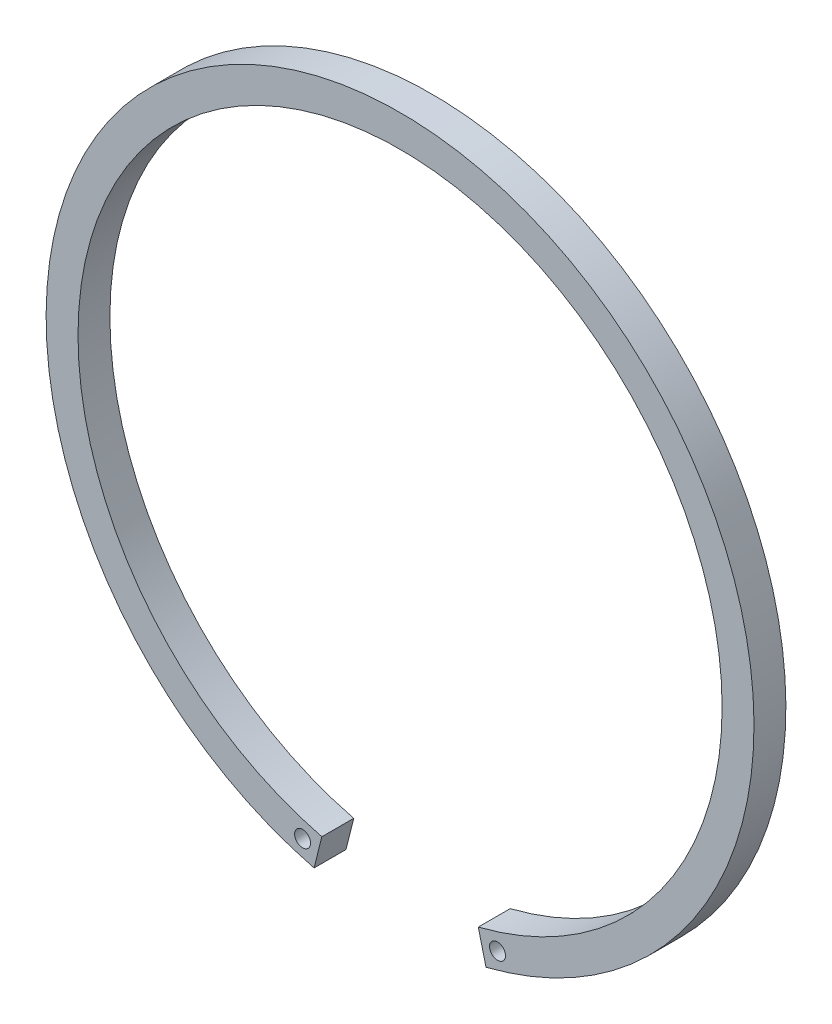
ISO-10303-21;
HEADER;
FILE_DESCRIPTION(('STEP AP214'),'2;1');
FILE_NAME('part.step','',(''),(''),'','','');
FILE_SCHEMA(('AUTOMOTIVE_DESIGN { 1 0 10303 214 1 1 1 1 }'));
ENDSEC;
DATA;
#1=APPLICATION_CONTEXT('core data for automotive mechanical design processes');
#2=APPLICATION_PROTOCOL_DEFINITION('international standard','automotive_design',2000,#1);
#3=PRODUCT_CONTEXT('',#1,'mechanical');
#4=PRODUCT('Part','Part','',(#3));
#5=PRODUCT_RELATED_PRODUCT_CATEGORY('part','',(#4));
#6=PRODUCT_DEFINITION_FORMATION('','',#4);
#7=PRODUCT_DEFINITION_CONTEXT('part definition',#1,'design');
#8=PRODUCT_DEFINITION('design','',#6,#7);
#9=PRODUCT_DEFINITION_SHAPE('','',#8);
#10=(LENGTH_UNIT() NAMED_UNIT(*) SI_UNIT(.MILLI.,.METRE.));
#11=(NAMED_UNIT(*) PLANE_ANGLE_UNIT() SI_UNIT($,.RADIAN.));
#12=(NAMED_UNIT(*) SI_UNIT($,.STERADIAN.) SOLID_ANGLE_UNIT());
#13=UNCERTAINTY_MEASURE_WITH_UNIT(LENGTH_MEASURE(1.E-05),#10,'distance_accuracy_value','');
#14=(GEOMETRIC_REPRESENTATION_CONTEXT(3) GLOBAL_UNCERTAINTY_ASSIGNED_CONTEXT((#13)) GLOBAL_UNIT_ASSIGNED_CONTEXT((#10,
#11,#12)) REPRESENTATION_CONTEXT('',''));
#15=CARTESIAN_POINT('',(0.,0.,0.));
#16=DIRECTION('',(0.,0.,1.));
#17=DIRECTION('',(1.,0.,0.));
#18=AXIS2_PLACEMENT_3D('',#15,#16,#17);
#19=CARTESIAN_POINT('',(-57.73146113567,-56.02523486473,5.));
#20=DIRECTION('',(0.,0.,1.));
#21=DIRECTION('',(1.,0.,0.));
#22=AXIS2_PLACEMENT_3D('',#19,#20,#21);
#23=PLANE('',#22);
#24=CARTESIAN_POINT('',(-15.2821772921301,-50.74894143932,5.));
#25=DIRECTION('',(0.,0.,1.));
#26=DIRECTION('',(1.,0.,0.));
#27=AXIS2_PLACEMENT_3D('',#24,#25,#26);
#28=CIRCLE('',#27,1.25);
#29=CARTESIAN_POINT('',(-14.0321772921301,-50.74894143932,5.));
#30=VERTEX_POINT('',#29);
#31=EDGE_CURVE('E100',#30,#30,#28,.F.);
#32=ORIENTED_EDGE('',*,*,#31,.T.);
#33=EDGE_LOOP('',(#32));
#34=FACE_BOUND('',#33,.T.);
#35=CARTESIAN_POINT('',(15.2821772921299,-50.74894143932,5.));
#36=DIRECTION('',(0.,0.,1.));
#37=DIRECTION('',(1.,0.,0.));
#38=AXIS2_PLACEMENT_3D('',#35,#36,#37);
#39=CIRCLE('',#38,1.25);
#40=CARTESIAN_POINT('',(16.5321772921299,-50.74894143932,5.));
#41=VERTEX_POINT('',#40);
#42=EDGE_CURVE('E77',#41,#41,#39,.F.);
#43=ORIENTED_EDGE('',*,*,#42,.T.);
#44=EDGE_LOOP('',(#43));
#45=FACE_BOUND('',#44,.T.);
#46=CARTESIAN_POINT('',(0.,0.,5.));
#47=DIRECTION('',(0.,0.,1.));
#48=DIRECTION('',(1.,0.,0.));
#49=AXIS2_PLACEMENT_3D('',#46,#47,#48);
#50=CIRCLE('',#49,50.5);
#51=CARTESIAN_POINT('',(-12.2642093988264,-48.9881533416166,5.));
#52=VERTEX_POINT('',#51);
#53=CARTESIAN_POINT('',(12.2642093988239,-48.9881533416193,5.));
#54=VERTEX_POINT('',#53);
#55=EDGE_CURVE('E80',#52,#54,#50,.F.);
#56=ORIENTED_EDGE('',*,*,#55,.T.);
#57=DIRECTION('',(-0.242855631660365,0.97006244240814,0.));
#58=VECTOR('',#57,1.);
#59=CARTESIAN_POINT('',(12.8713484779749,-51.41330944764,5.));
#60=LINE('',#59,#58);
#61=CARTESIAN_POINT('',(13.4784875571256,-53.8384655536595,5.));
#62=VERTEX_POINT('',#61);
#63=EDGE_CURVE('E75',#54,#62,#60,.F.);
#64=ORIENTED_EDGE('',*,*,#63,.T.);
#65=CARTESIAN_POINT('',(0.,0.,5.));
#66=DIRECTION('',(0.,0.,1.));
#67=DIRECTION('',(1.,0.,0.));
#68=AXIS2_PLACEMENT_3D('',#65,#66,#67);
#69=CIRCLE('',#68,55.5);
#70=CARTESIAN_POINT('',(-13.4784875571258,-53.8384655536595,5.));
#71=VERTEX_POINT('',#70);
#72=EDGE_CURVE('E29',#62,#71,#69,.T.);
#73=ORIENTED_EDGE('',*,*,#72,.T.);
#74=DIRECTION('',(-0.242855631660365,-0.97006244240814,0.));
#75=VECTOR('',#74,1.);
#76=CARTESIAN_POINT('',(-12.8713484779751,-51.41330944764,5.));
#77=LINE('',#76,#75);
#78=EDGE_CURVE('E86',#71,#52,#77,.F.);
#79=ORIENTED_EDGE('',*,*,#78,.T.);
#80=EDGE_LOOP('',(#56,#64,#73,#79));
#81=FACE_BOUND('',#80,.T.);
#82=ADVANCED_FACE('F25',(#34,#45,#81),#23,.T.);
#83=CARTESIAN_POINT('',(0.,0.,0.));
#84=DIRECTION('',(0.,0.,1.));
#85=DIRECTION('',(1.,0.,0.));
#86=AXIS2_PLACEMENT_3D('',#83,#84,#85);
#87=CYLINDRICAL_SURFACE('',#86,55.5);
#88=ORIENTED_EDGE('',*,*,#72,.F.);
#89=DIRECTION('',(0.,0.,1.));
#90=VECTOR('',#89,1.);
#91=CARTESIAN_POINT('',(13.4784875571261,-53.838465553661,2.49999999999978));
#92=LINE('',#91,#90);
#93=CARTESIAN_POINT('',(13.4784875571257,-53.8384655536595,0.));
#94=VERTEX_POINT('',#93);
#95=EDGE_CURVE('E69',#62,#94,#92,.F.);
#96=ORIENTED_EDGE('',*,*,#95,.T.);
#97=CARTESIAN_POINT('',(0.,0.,0.));
#98=DIRECTION('',(0.,0.,1.));
#99=DIRECTION('',(1.,0.,0.));
#100=AXIS2_PLACEMENT_3D('',#97,#98,#99);
#101=CIRCLE('',#100,55.5);
#102=CARTESIAN_POINT('',(-13.4784875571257,-53.8384655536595,0.));
#103=VERTEX_POINT('',#102);
#104=EDGE_CURVE('E98',#94,#103,#101,.T.);
#105=ORIENTED_EDGE('',*,*,#104,.T.);
#106=DIRECTION('',(0.,0.,-1.));
#107=VECTOR('',#106,1.);
#108=CARTESIAN_POINT('',(-13.4784875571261,-53.838465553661,2.49999999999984));
#109=LINE('',#108,#107);
#110=EDGE_CURVE('E70',#103,#71,#109,.F.);
#111=ORIENTED_EDGE('',*,*,#110,.T.);
#112=EDGE_LOOP('',(#88,#96,#105,#111));
#113=FACE_BOUND('',#112,.T.);
#114=ADVANCED_FACE('F67',(#113),#87,.T.);
#115=CARTESIAN_POINT('',(-13.52392190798,-54.01994850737,-0.187083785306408));
#116=DIRECTION('',(0.97006244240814,-0.242855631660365,0.));
#117=DIRECTION('',(0.242855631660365,0.97006244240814,0.));
#118=AXIS2_PLACEMENT_3D('',#115,#116,#117);
#119=PLANE('',#118);
#120=ORIENTED_EDGE('',*,*,#78,.F.);
#121=ORIENTED_EDGE('',*,*,#110,.F.);
#122=DIRECTION('',(0.242855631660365,0.97006244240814,0.));
#123=VECTOR('',#122,1.);
#124=CARTESIAN_POINT('',(-13.52392190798,-54.01994850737,0.));
#125=LINE('',#124,#123);
#126=CARTESIAN_POINT('',(-12.2642093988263,-48.9881533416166,0.));
#127=VERTEX_POINT('',#126);
#128=EDGE_CURVE('E95',#103,#127,#125,.T.);
#129=ORIENTED_EDGE('',*,*,#128,.T.);
#130=DIRECTION('',(0.,0.,-1.));
#131=VECTOR('',#130,1.);
#132=CARTESIAN_POINT('',(-12.264209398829,-48.9881533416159,2.49999999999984));
#133=LINE('',#132,#131);
#134=EDGE_CURVE('E87',#127,#52,#133,.F.);
#135=ORIENTED_EDGE('',*,*,#134,.T.);
#136=EDGE_LOOP('',(#120,#121,#129,#135));
#137=FACE_BOUND('',#136,.T.);
#138=ADVANCED_FACE('F106',(#137),#119,.T.);
#139=CARTESIAN_POINT('',(0.,0.,0.));
#140=DIRECTION('',(0.,0.,1.));
#141=DIRECTION('',(1.,0.,0.));
#142=AXIS2_PLACEMENT_3D('',#139,#140,#141);
#143=CYLINDRICAL_SURFACE('',#142,50.5);
#144=ORIENTED_EDGE('',*,*,#55,.F.);
#145=ORIENTED_EDGE('',*,*,#134,.F.);
#146=CARTESIAN_POINT('',(0.,0.,0.));
#147=DIRECTION('',(0.,0.,1.));
#148=DIRECTION('',(1.,0.,0.));
#149=AXIS2_PLACEMENT_3D('',#146,#147,#148);
#150=CIRCLE('',#149,50.5);
#151=CARTESIAN_POINT('',(12.264209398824,-48.9881533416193,0.));
#152=VERTEX_POINT('',#151);
#153=EDGE_CURVE('E92',#127,#152,#150,.F.);
#154=ORIENTED_EDGE('',*,*,#153,.T.);
#155=DIRECTION('',(0.,0.,-1.));
#156=VECTOR('',#155,1.);
#157=CARTESIAN_POINT('',(12.2642093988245,-48.9881533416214,2.49999999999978));
#158=LINE('',#157,#156);
#159=EDGE_CURVE('E44',#152,#54,#158,.F.);
#160=ORIENTED_EDGE('',*,*,#159,.T.);
#161=EDGE_LOOP('',(#144,#145,#154,#160));
#162=FACE_BOUND('',#161,.T.);
#163=ADVANCED_FACE('F110',(#162),#143,.F.);
#164=CARTESIAN_POINT('',(12.21877504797,-48.80667038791,-0.187083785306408));
#165=DIRECTION('',(-0.97006244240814,-0.242855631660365,0.));
#166=DIRECTION('',(0.242855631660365,-0.97006244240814,0.));
#167=AXIS2_PLACEMENT_3D('',#164,#165,#166);
#168=PLANE('',#167);
#169=ORIENTED_EDGE('',*,*,#63,.F.);
#170=ORIENTED_EDGE('',*,*,#159,.F.);
#171=DIRECTION('',(0.242855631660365,-0.97006244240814,0.));
#172=VECTOR('',#171,1.);
#173=CARTESIAN_POINT('',(12.21877504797,-48.80667038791,0.));
#174=LINE('',#173,#172);
#175=EDGE_CURVE('E76',#152,#94,#174,.T.);
#176=ORIENTED_EDGE('',*,*,#175,.T.);
#177=ORIENTED_EDGE('',*,*,#95,.F.);
#178=EDGE_LOOP('',(#169,#170,#176,#177));
#179=FACE_BOUND('',#178,.T.);
#180=ADVANCED_FACE('F74',(#179),#168,.T.);
#181=CARTESIAN_POINT('',(15.28217729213,-50.74894143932,0.));
#182=DIRECTION('',(0.,0.,1.));
#183=DIRECTION('',(1.,0.,0.));
#184=AXIS2_PLACEMENT_3D('',#181,#182,#183);
#185=CYLINDRICAL_SURFACE('',#184,1.25);
#186=ORIENTED_EDGE('',*,*,#42,.F.);
#187=EDGE_LOOP('',(#186));
#188=FACE_BOUND('',#187,.T.);
#189=CARTESIAN_POINT('',(15.28217729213,-50.74894143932,0.));
#190=DIRECTION('',(0.,0.,1.));
#191=DIRECTION('',(1.,0.,0.));
#192=AXIS2_PLACEMENT_3D('',#189,#190,#191);
#193=CIRCLE('',#192,1.25);
#194=CARTESIAN_POINT('',(16.53217729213,-50.74894143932,0.));
#195=VERTEX_POINT('',#194);
#196=EDGE_CURVE('E35',#195,#195,#193,.F.);
#197=ORIENTED_EDGE('',*,*,#196,.T.);
#198=EDGE_LOOP('',(#197));
#199=FACE_BOUND('',#198,.T.);
#200=ADVANCED_FACE('F119',(#188,#199),#185,.F.);
#201=CARTESIAN_POINT('',(-15.28217729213,-50.74894143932,0.));
#202=DIRECTION('',(0.,0.,1.));
#203=DIRECTION('',(1.,0.,0.));
#204=AXIS2_PLACEMENT_3D('',#201,#202,#203);
#205=CYLINDRICAL_SURFACE('',#204,1.25);
#206=ORIENTED_EDGE('',*,*,#31,.F.);
#207=EDGE_LOOP('',(#206));
#208=FACE_BOUND('',#207,.T.);
#209=CARTESIAN_POINT('',(-15.28217729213,-50.74894143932,0.));
#210=DIRECTION('',(0.,0.,1.));
#211=DIRECTION('',(1.,0.,0.));
#212=AXIS2_PLACEMENT_3D('',#209,#210,#211);
#213=CIRCLE('',#212,1.25);
#214=CARTESIAN_POINT('',(-14.03217729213,-50.74894143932,0.));
#215=VERTEX_POINT('',#214);
#216=EDGE_CURVE('E13',#215,#215,#213,.F.);
#217=ORIENTED_EDGE('',*,*,#216,.T.);
#218=EDGE_LOOP('',(#217));
#219=FACE_BOUND('',#218,.T.);
#220=ADVANCED_FACE('F113',(#208,#219),#205,.F.);
#221=CARTESIAN_POINT('',(-57.73146113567,-56.02523486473,0.));
#222=DIRECTION('',(0.,0.,1.));
#223=DIRECTION('',(1.,0.,0.));
#224=AXIS2_PLACEMENT_3D('',#221,#222,#223);
#225=PLANE('',#224);
#226=ORIENTED_EDGE('',*,*,#216,.F.);
#227=EDGE_LOOP('',(#226));
#228=FACE_BOUND('',#227,.T.);
#229=ORIENTED_EDGE('',*,*,#196,.F.);
#230=EDGE_LOOP('',(#229));
#231=FACE_BOUND('',#230,.T.);
#232=ORIENTED_EDGE('',*,*,#153,.F.);
#233=ORIENTED_EDGE('',*,*,#128,.F.);
#234=ORIENTED_EDGE('',*,*,#104,.F.);
#235=ORIENTED_EDGE('',*,*,#175,.F.);
#236=EDGE_LOOP('',(#232,#233,#234,#235));
#237=FACE_BOUND('',#236,.T.);
#238=ADVANCED_FACE('F27',(#228,#231,#237),#225,.F.);
#239=CLOSED_SHELL('',(#82,#114,#138,#163,#180,#200,#220,#238));
#240=MANIFOLD_SOLID_BREP('B1',#239);
#241=ADVANCED_BREP_SHAPE_REPRESENTATION('',(#18,#240),#14);
#242=SHAPE_DEFINITION_REPRESENTATION(#9,#241);
ENDSEC;
END-ISO-10303-21;
